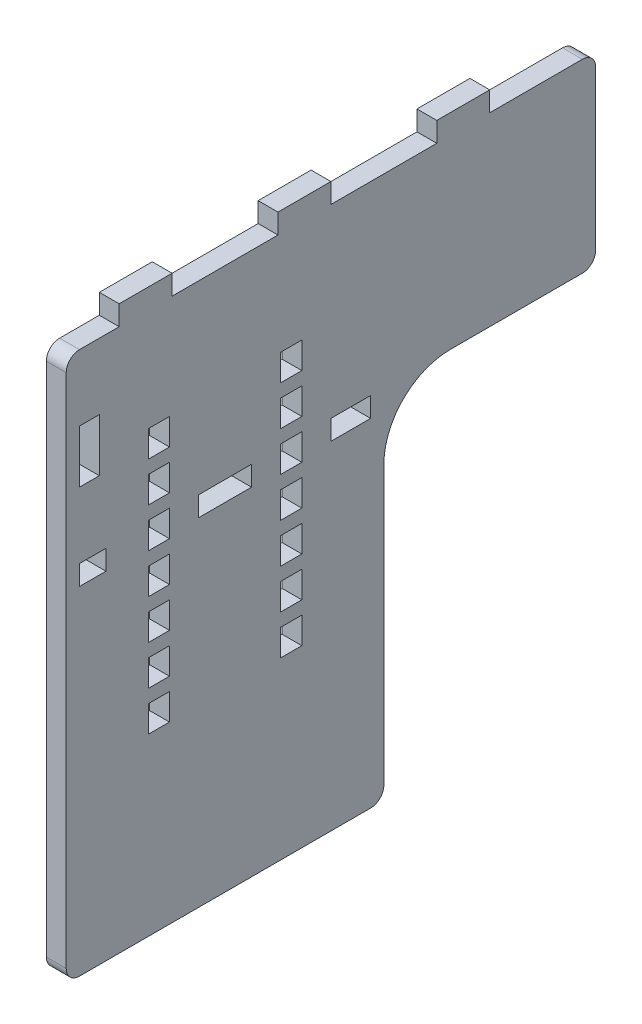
from build123d import *

# Parameters (mm, degrees)
SALIENTE_EXTRUIR1_DEPTH = 15
REDONDEO1_R             = 50
CROQUIS2_W              = 16
CROQUIS2_H              = 20
CORTAR_EXTRUIR3_DEPTH   = 573.996509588
REDONDEO2_R             = 10
SALIENTE_EXTRUIR2_START = 410
CROQUIS3_W              = 15
CROQUIS3_H              = 40
SALIENTE_EXTRUIR2_DEPTH = 15
CROQUIS4_W              = 15
CROQUIS4_H              = 40
CORTAR_EXTRUIR4_DEPTH   = 15
CROQUIS5_W              = 40
CROQUIS5_H              = 15
CORTAR_EXTRUIR5_DEPTH   = 15
CROQUIS6_W              = 20
CROQUIS6_H              = 15
CORTAR_EXTRUIR6_DEPTH   = 20
CROQUIS7_W              = 30
CROQUIS7_H              = 15
CORTAR_EXTRUIR7_DEPTH   = 15


with BuildPart() as part:
    # Croquis1 → Saliente-Extruir1 (new body)
    with BuildSketch(Plane(origin=(0, 0, 0), x_dir=(0, 0, -1), z_dir=(1, 0, 0))):
        Polygon((0, 0), (0, 410), (400, 410), (400, 270), (240, 270), (240, 0), align=None)
    extrude(amount=SALIENTE_EXTRUIR1_DEPTH)

    # Redondeo1
    redondeo1_edges = [part.edges().sort_by_distance(p)[0] for p in [
        (7.5, 270, -240),
    ]]
    fillet(redondeo1_edges, radius=REDONDEO1_R)

    # Croquis2 → Cortar-Extruir3 (cut, through all)
    with BuildSketch(Plane(origin=(0, 0, 0), x_dir=(0, 0, -1), z_dir=(1, 0, 0))):
        with Locations((170, 322.29308097)):
            Rectangle(CROQUIS2_W, CROQUIS2_H)
        with Locations((170, 292.29308097)):
            Rectangle(CROQUIS2_W, CROQUIS2_H)
        with Locations((170, 262.29308097)):
            Rectangle(CROQUIS2_W, CROQUIS2_H)
        with Locations((170, 232.29308097)):
            Rectangle(CROQUIS2_W, CROQUIS2_H)
        with Locations((170, 202.29308097)):
            Rectangle(CROQUIS2_W, CROQUIS2_H)
        with Locations((170, 172.29308097)):
            Rectangle(CROQUIS2_W, CROQUIS2_H)
        with Locations((170, 142.29308097)):
            Rectangle(CROQUIS2_W, CROQUIS2_H)
        with Locations((70, 322.29308097)):
            Rectangle(CROQUIS2_W, CROQUIS2_H)
        with Locations((70, 292.29308097)):
            Rectangle(CROQUIS2_W, CROQUIS2_H)
        with Locations((70, 262.29308097)):
            Rectangle(CROQUIS2_W, CROQUIS2_H)
        with Locations((70, 232.29308097)):
            Rectangle(CROQUIS2_W, CROQUIS2_H)
        with Locations((70, 202.29308097)):
            Rectangle(CROQUIS2_W, CROQUIS2_H)
        with Locations((70, 172.29308097)):
            Rectangle(CROQUIS2_W, CROQUIS2_H)
        with Locations((70, 142.29308097)):
            Rectangle(CROQUIS2_W, CROQUIS2_H)
    extrude(amount=CORTAR_EXTRUIR3_DEPTH, mode=Mode.SUBTRACT)

    # Redondeo2
    redondeo2_edges = [part.edges().sort_by_distance(p)[0] for p in [
        (7.5, 0, 0),
        (7.5, 410, 0),
        (7.5, 410, -400),
        (7.5, 270, -400),
        (7.5, 0, -240),
    ]]
    fillet(redondeo2_edges, radius=REDONDEO2_R)

    # Croquis3 → Saliente-Extruir2 (add)
    with BuildSketch(Plane(origin=(0, 0, 0), x_dir=(1, 0, 0), z_dir=(0, 1, 0)).offset(SALIENTE_EXTRUIR2_START)):
        with Locations((7.5, 300)):
            Rectangle(CROQUIS3_W, CROQUIS3_H)
        with Locations((7.5, 60)):
            Rectangle(CROQUIS3_W, CROQUIS3_H)
        with Locations((7.5, 180)):
            Rectangle(CROQUIS3_W, CROQUIS3_H)
    extrude(amount=SALIENTE_EXTRUIR2_DEPTH)

    # Croquis4 → Cortar-Extruir4 (cut)
    with BuildSketch(Plane(origin=(0, 0, 0), x_dir=(0, 0, -1), z_dir=(1, 0, 0))):
        with Locations((17.5, 340)):
            Rectangle(CROQUIS4_W, CROQUIS4_H)
    extrude(amount=CORTAR_EXTRUIR4_DEPTH, mode=Mode.SUBTRACT)

    # Croquis5 → Cortar-Extruir5 (cut)
    with BuildSketch(Plane(origin=(0, 0, 0), x_dir=(0, 0, -1), z_dir=(1, 0, 0))):
        with Locations((120, 262.5)):
            Rectangle(CROQUIS5_W, CROQUIS5_H)
    extrude(amount=CORTAR_EXTRUIR5_DEPTH, mode=Mode.SUBTRACT)

    # Croquis6 → Cortar-Extruir6 (cut)
    with BuildSketch(Plane(origin=(0, 0, 0), x_dir=(0, 0, -1), z_dir=(1, 0, 0))):
        with Locations((20, 262.5)):
            Rectangle(CROQUIS6_W, CROQUIS6_H)
    extrude(amount=CORTAR_EXTRUIR6_DEPTH, mode=Mode.SUBTRACT)

    # Croquis7 → Cortar-Extruir7 (cut)
    with BuildSketch(Plane(origin=(0, 0, 0), x_dir=(0, 0, -1), z_dir=(1, 0, 0))):
        with Locations((215, 262.5)):
            Rectangle(CROQUIS7_W, CROQUIS7_H)
    extrude(amount=CORTAR_EXTRUIR7_DEPTH, mode=Mode.SUBTRACT)


solid = part.part
